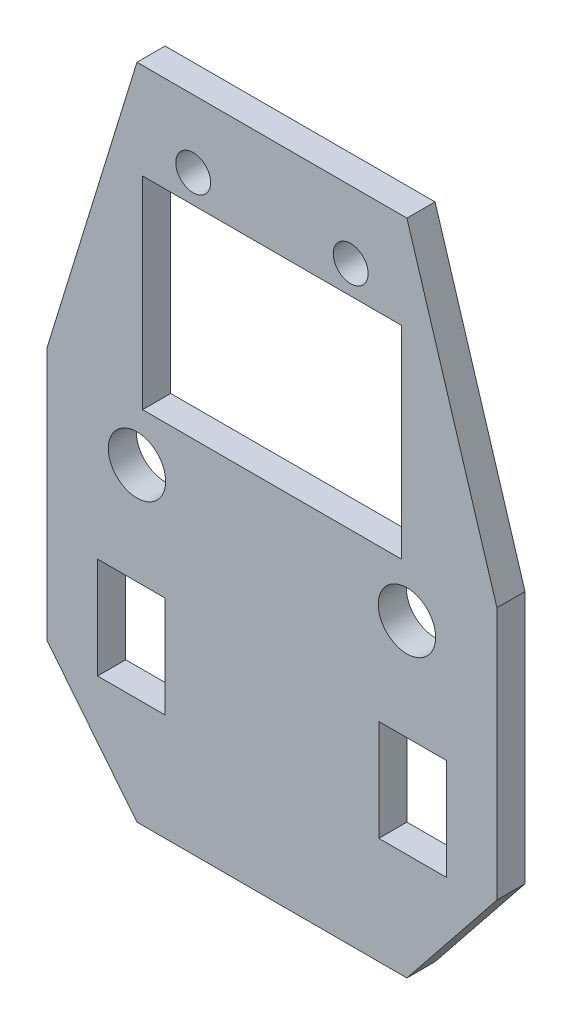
from build123d import *

# Parameters (mm, degrees)
PALM_FRAME_DEPTH                 = 2.5
SKETCH_2_R                       = 5.1
SKETCH_2_R_2                     = 3.1
GROUND_PIVOT_BORES_DEPTH         = 250
SKETCH_3_W                       = 46
SKETCH_3_H                       = 36
SKETCH_3_W_2                     = 12
SKETCH_3_H_2                     = 18
LINKAGE_INSPECTION_WINDOWS_DEPTH = 250


with BuildPart() as part:
    # Sketch 1 → Palm_Frame (new, symmetric)
    with BuildSketch(Plane.XY):
        Polygon((-40, -35), (-24, -55), (24, -55), (40, -35), (40, 10), (24, 62), (-24, 62), (-40, 10), align=None)
    extrude(amount=PALM_FRAME_DEPTH, both=True)

    # Sketch 2 → Ground_Pivot_Bores (cut, symmetric)
    with BuildSketch(Plane.XY):
        with Locations((-24, 0)):
            Circle(SKETCH_2_R)
        with Locations((24, 0)):
            Circle(SKETCH_2_R)
        with Locations((-14, 50)):
            Circle(SKETCH_2_R_2)
        with Locations((14, 50)):
            Circle(SKETCH_2_R_2)
    extrude(amount=GROUND_PIVOT_BORES_DEPTH, both=True, mode=Mode.SUBTRACT)

    # Sketch 3 → Linkage_Inspection_Windows (cut, symmetric)
    with BuildSketch(Plane.XY):
        with Locations((0, 27)):
            Rectangle(SKETCH_3_W, SKETCH_3_H)
        with Locations((-25, -27)):
            Rectangle(SKETCH_3_W_2, SKETCH_3_H_2)
        with Locations((25, -27)):
            Rectangle(SKETCH_3_W_2, SKETCH_3_H_2)
    extrude(amount=LINKAGE_INSPECTION_WINDOWS_DEPTH, both=True, mode=Mode.SUBTRACT)


solid = part.part
